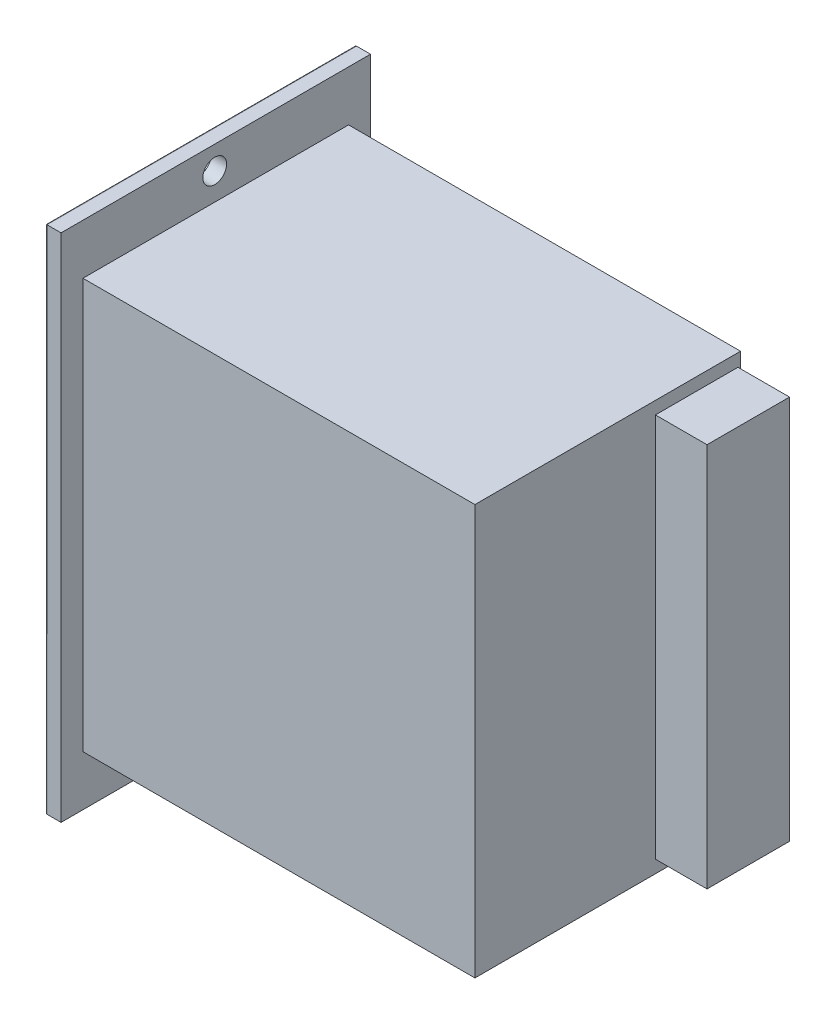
ISO-10303-21;
HEADER;
FILE_DESCRIPTION(('STEP AP214'),'2;1');
FILE_NAME('part.step','',(''),(''),'','','');
FILE_SCHEMA(('AUTOMOTIVE_DESIGN { 1 0 10303 214 1 1 1 1 }'));
ENDSEC;
DATA;
#1=APPLICATION_CONTEXT('core data for automotive mechanical design processes');
#2=APPLICATION_PROTOCOL_DEFINITION('international standard','automotive_design',2000,#1);
#3=PRODUCT_CONTEXT('',#1,'mechanical');
#4=PRODUCT('Part','Part','',(#3));
#5=PRODUCT_RELATED_PRODUCT_CATEGORY('part','',(#4));
#6=PRODUCT_DEFINITION_FORMATION('','',#4);
#7=PRODUCT_DEFINITION_CONTEXT('part definition',#1,'design');
#8=PRODUCT_DEFINITION('design','',#6,#7);
#9=PRODUCT_DEFINITION_SHAPE('','',#8);
#10=(LENGTH_UNIT() NAMED_UNIT(*) SI_UNIT(.MILLI.,.METRE.));
#11=(NAMED_UNIT(*) PLANE_ANGLE_UNIT() SI_UNIT($,.RADIAN.));
#12=(NAMED_UNIT(*) SI_UNIT($,.STERADIAN.) SOLID_ANGLE_UNIT());
#13=UNCERTAINTY_MEASURE_WITH_UNIT(LENGTH_MEASURE(1.E-05),#10,'distance_accuracy_value','');
#14=(GEOMETRIC_REPRESENTATION_CONTEXT(3) GLOBAL_UNCERTAINTY_ASSIGNED_CONTEXT((#13)) GLOBAL_UNIT_ASSIGNED_CONTEXT((#10,
#11,#12)) REPRESENTATION_CONTEXT('',''));
#15=CARTESIAN_POINT('',(0.,0.,0.));
#16=DIRECTION('',(0.,0.,1.));
#17=DIRECTION('',(1.,0.,0.));
#18=AXIS2_PLACEMENT_3D('',#15,#16,#17);
#19=CARTESIAN_POINT('',(-1.6,0.,0.));
#20=DIRECTION('',(1.,0.,0.));
#21=DIRECTION('',(0.,0.,-1.));
#22=AXIS2_PLACEMENT_3D('',#19,#20,#21);
#23=PLANE('',#22);
#24=DIRECTION('',(0.,-1.,0.));
#25=VECTOR('',#24,1.);
#26=CARTESIAN_POINT('',(-1.6,0.,-23.9));
#27=LINE('',#26,#25);
#28=CARTESIAN_POINT('',(-1.6,37.15,-23.9));
#29=VERTEX_POINT('',#28);
#30=CARTESIAN_POINT('',(-1.6,-37.15,-23.9));
#31=VERTEX_POINT('',#30);
#32=EDGE_CURVE('E55',#29,#31,#27,.T.);
#33=ORIENTED_EDGE('',*,*,#32,.T.);
#34=DIRECTION('',(0.,0.,1.));
#35=VECTOR('',#34,1.);
#36=CARTESIAN_POINT('',(-1.6,-37.15,0.));
#37=LINE('',#36,#35);
#38=CARTESIAN_POINT('',(-1.6,-37.15,23.9));
#39=VERTEX_POINT('',#38);
#40=EDGE_CURVE('E12',#31,#39,#37,.T.);
#41=ORIENTED_EDGE('',*,*,#40,.T.);
#42=DIRECTION('',(0.,1.,0.));
#43=VECTOR('',#42,1.);
#44=CARTESIAN_POINT('',(-1.6,0.,23.9));
#45=LINE('',#44,#43);
#46=CARTESIAN_POINT('',(-1.6,37.15,23.9));
#47=VERTEX_POINT('',#46);
#48=EDGE_CURVE('E111',#39,#47,#45,.T.);
#49=ORIENTED_EDGE('',*,*,#48,.T.);
#50=DIRECTION('',(0.,0.,-1.));
#51=VECTOR('',#50,1.);
#52=CARTESIAN_POINT('',(-1.6,37.15,0.));
#53=LINE('',#52,#51);
#54=EDGE_CURVE('E66',#47,#29,#53,.T.);
#55=ORIENTED_EDGE('',*,*,#54,.T.);
#56=EDGE_LOOP('',(#33,#41,#49,#55));
#57=FACE_BOUND('',#56,.T.);
#58=ADVANCED_FACE('F46',(#57),#23,.F.);
#59=CARTESIAN_POINT('',(0.,0.,0.));
#60=DIRECTION('',(1.,0.,0.));
#61=DIRECTION('',(0.,0.,-1.));
#62=AXIS2_PLACEMENT_3D('',#59,#60,#61);
#63=PLANE('',#62);
#64=DIRECTION('',(0.,1.,0.));
#65=VECTOR('',#64,1.);
#66=CARTESIAN_POINT('',(0.,-38.75,25.5));
#67=LINE('',#66,#65);
#68=CARTESIAN_POINT('',(0.,-38.75,25.5));
#69=VERTEX_POINT('',#68);
#70=CARTESIAN_POINT('',(0.,38.75,25.5));
#71=VERTEX_POINT('',#70);
#72=EDGE_CURVE('E91',#69,#71,#67,.T.);
#73=ORIENTED_EDGE('',*,*,#72,.F.);
#74=DIRECTION('',(0.,0.,1.));
#75=VECTOR('',#74,1.);
#76=CARTESIAN_POINT('',(0.,-38.75,-25.5));
#77=LINE('',#76,#75);
#78=CARTESIAN_POINT('',(0.,-38.75,-25.5));
#79=VERTEX_POINT('',#78);
#80=EDGE_CURVE('E109',#79,#69,#77,.T.);
#81=ORIENTED_EDGE('',*,*,#80,.F.);
#82=DIRECTION('',(0.,-1.,0.));
#83=VECTOR('',#82,1.);
#84=CARTESIAN_POINT('',(0.,-38.75,-25.5));
#85=LINE('',#84,#83);
#86=CARTESIAN_POINT('',(0.,38.75,-25.5));
#87=VERTEX_POINT('',#86);
#88=EDGE_CURVE('E94',#87,#79,#85,.T.);
#89=ORIENTED_EDGE('',*,*,#88,.F.);
#90=DIRECTION('',(0.,0.,-1.));
#91=VECTOR('',#90,1.);
#92=CARTESIAN_POINT('',(0.,38.75,-25.5));
#93=LINE('',#92,#91);
#94=EDGE_CURVE('E86',#71,#87,#93,.T.);
#95=ORIENTED_EDGE('',*,*,#94,.F.);
#96=EDGE_LOOP('',(#73,#81,#89,#95));
#97=FACE_BOUND('',#96,.T.);
#98=ADVANCED_FACE('F88',(#97),#63,.T.);
#99=CARTESIAN_POINT('',(-1.6,37.15,0.));
#100=DIRECTION('',(0.707106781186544,-0.707106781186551,0.));
#101=DIRECTION('',(0.,0.,-1.));
#102=AXIS2_PLACEMENT_3D('',#99,#100,#101);
#103=PLANE('',#102);
#104=DIRECTION('',(-0.577350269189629,-0.577350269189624,-0.577350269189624));
#105=VECTOR('',#104,1.);
#106=CARTESIAN_POINT('',(-13.9833333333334,24.7666666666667,11.5166666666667));
#107=LINE('',#106,#105);
#108=EDGE_CURVE('E99',#71,#47,#107,.T.);
#109=ORIENTED_EDGE('',*,*,#108,.F.);
#110=ORIENTED_EDGE('',*,*,#94,.T.);
#111=DIRECTION('',(-0.577350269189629,-0.577350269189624,0.577350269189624));
#112=VECTOR('',#111,1.);
#113=CARTESIAN_POINT('',(-9.5666666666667,29.1833333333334,-15.9333333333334));
#114=LINE('',#113,#112);
#115=EDGE_CURVE('E50',#29,#87,#114,.F.);
#116=ORIENTED_EDGE('',*,*,#115,.F.);
#117=ORIENTED_EDGE('',*,*,#54,.F.);
#118=EDGE_LOOP('',(#109,#110,#116,#117));
#119=FACE_BOUND('',#118,.T.);
#120=ADVANCED_FACE('F48',(#119),#103,.F.);
#121=CARTESIAN_POINT('',(-1.6,0.,-23.9));
#122=DIRECTION('',(0.707106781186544,0.,0.707106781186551));
#123=DIRECTION('',(0.,-1.,0.));
#124=AXIS2_PLACEMENT_3D('',#121,#122,#123);
#125=PLANE('',#124);
#126=ORIENTED_EDGE('',*,*,#115,.T.);
#127=ORIENTED_EDGE('',*,*,#88,.T.);
#128=DIRECTION('',(-0.577350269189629,0.577350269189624,0.577350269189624));
#129=VECTOR('',#128,1.);
#130=CARTESIAN_POINT('',(-13.9833333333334,-24.7666666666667,-11.5166666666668));
#131=LINE('',#130,#129);
#132=EDGE_CURVE('E102',#31,#79,#131,.F.);
#133=ORIENTED_EDGE('',*,*,#132,.F.);
#134=ORIENTED_EDGE('',*,*,#32,.F.);
#135=EDGE_LOOP('',(#126,#127,#133,#134));
#136=FACE_BOUND('',#135,.T.);
#137=ADVANCED_FACE('F120',(#136),#125,.F.);
#138=CARTESIAN_POINT('',(-1.6,0.,23.9));
#139=DIRECTION('',(0.707106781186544,0.,-0.707106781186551));
#140=DIRECTION('',(0.,1.,0.));
#141=AXIS2_PLACEMENT_3D('',#138,#139,#140);
#142=PLANE('',#141);
#143=ORIENTED_EDGE('',*,*,#108,.T.);
#144=ORIENTED_EDGE('',*,*,#48,.F.);
#145=DIRECTION('',(0.577350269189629,-0.577350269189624,0.577350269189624));
#146=VECTOR('',#145,1.);
#147=CARTESIAN_POINT('',(-13.9833333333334,-24.7666666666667,11.5166666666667));
#148=LINE('',#147,#146);
#149=EDGE_CURVE('E105',#69,#39,#148,.F.);
#150=ORIENTED_EDGE('',*,*,#149,.F.);
#151=ORIENTED_EDGE('',*,*,#72,.T.);
#152=EDGE_LOOP('',(#143,#144,#150,#151));
#153=FACE_BOUND('',#152,.T.);
#154=ADVANCED_FACE('F104',(#153),#142,.F.);
#155=CARTESIAN_POINT('',(-1.6,-37.15,0.));
#156=DIRECTION('',(0.707106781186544,0.707106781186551,0.));
#157=DIRECTION('',(0.,0.,1.));
#158=AXIS2_PLACEMENT_3D('',#155,#156,#157);
#159=PLANE('',#158);
#160=ORIENTED_EDGE('',*,*,#132,.T.);
#161=ORIENTED_EDGE('',*,*,#80,.T.);
#162=ORIENTED_EDGE('',*,*,#149,.T.);
#163=ORIENTED_EDGE('',*,*,#40,.F.);
#164=EDGE_LOOP('',(#160,#161,#162,#163));
#165=FACE_BOUND('',#164,.T.);
#166=ADVANCED_FACE('F118',(#165),#159,.F.);
#167=CLOSED_SHELL('',(#58,#98,#120,#137,#154,#166));
#168=MANIFOLD_SOLID_BREP('B2',#167);
#169=CARTESIAN_POINT('',(89.,37.3,-9.25000000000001));
#170=DIRECTION('',(0.,-1.,0.));
#171=DIRECTION('',(0.,0.,-1.));
#172=AXIS2_PLACEMENT_3D('',#169,#170,#171);
#173=PLANE('',#172);
#174=DIRECTION('',(0.,0.,1.));
#175=VECTOR('',#174,1.);
#176=CARTESIAN_POINT('',(79.,37.3,-9.25000000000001));
#177=LINE('',#176,#175);
#178=CARTESIAN_POINT('',(79.,37.3,-25.25));
#179=VERTEX_POINT('',#178);
#180=CARTESIAN_POINT('',(79.,37.3,-9.25000000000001));
#181=VERTEX_POINT('',#180);
#182=EDGE_CURVE('E243',#179,#181,#177,.T.);
#183=ORIENTED_EDGE('',*,*,#182,.T.);
#184=DIRECTION('',(-1.,0.,0.));
#185=VECTOR('',#184,1.);
#186=CARTESIAN_POINT('',(89.,37.3,-9.25000000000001));
#187=LINE('',#186,#185);
#188=CARTESIAN_POINT('',(89.,37.3,-9.25000000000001));
#189=VERTEX_POINT('',#188);
#190=EDGE_CURVE('E44',#189,#181,#187,.T.);
#191=ORIENTED_EDGE('',*,*,#190,.F.);
#192=DIRECTION('',(0.,0.,1.));
#193=VECTOR('',#192,1.);
#194=CARTESIAN_POINT('',(89.,37.3,-9.25000000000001));
#195=LINE('',#194,#193);
#196=CARTESIAN_POINT('',(89.,37.3,-25.25));
#197=VERTEX_POINT('',#196);
#198=EDGE_CURVE('E231',#197,#189,#195,.T.);
#199=ORIENTED_EDGE('',*,*,#198,.F.);
#200=DIRECTION('',(-1.,0.,0.));
#201=VECTOR('',#200,1.);
#202=CARTESIAN_POINT('',(89.,37.3,-25.25));
#203=LINE('',#202,#201);
#204=EDGE_CURVE('E239',#197,#179,#203,.T.);
#205=ORIENTED_EDGE('',*,*,#204,.T.);
#206=EDGE_LOOP('',(#183,#191,#199,#205));
#207=FACE_BOUND('',#206,.T.);
#208=ADVANCED_FACE('F180',(#207),#173,.F.);
#209=CARTESIAN_POINT('',(89.,-37.3,-9.25000000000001));
#210=DIRECTION('',(0.,0.,-1.));
#211=DIRECTION('',(-1.,0.,0.));
#212=AXIS2_PLACEMENT_3D('',#209,#210,#211);
#213=PLANE('',#212);
#214=DIRECTION('',(0.,-1.,0.));
#215=VECTOR('',#214,1.);
#216=CARTESIAN_POINT('',(79.,-37.3,-9.25000000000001));
#217=LINE('',#216,#215);
#218=CARTESIAN_POINT('',(79.,-37.3,-9.25000000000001));
#219=VERTEX_POINT('',#218);
#220=EDGE_CURVE('E235',#181,#219,#217,.T.);
#221=ORIENTED_EDGE('',*,*,#220,.T.);
#222=DIRECTION('',(-1.,0.,0.));
#223=VECTOR('',#222,1.);
#224=CARTESIAN_POINT('',(89.,-37.3,-9.25000000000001));
#225=LINE('',#224,#223);
#226=CARTESIAN_POINT('',(89.,-37.3,-9.25000000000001));
#227=VERTEX_POINT('',#226);
#228=EDGE_CURVE('E188',#227,#219,#225,.T.);
#229=ORIENTED_EDGE('',*,*,#228,.F.);
#230=DIRECTION('',(0.,-1.,0.));
#231=VECTOR('',#230,1.);
#232=CARTESIAN_POINT('',(89.,-37.3,-9.25000000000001));
#233=LINE('',#232,#231);
#234=EDGE_CURVE('E226',#189,#227,#233,.T.);
#235=ORIENTED_EDGE('',*,*,#234,.F.);
#236=ORIENTED_EDGE('',*,*,#190,.T.);
#237=EDGE_LOOP('',(#221,#229,#235,#236));
#238=FACE_BOUND('',#237,.T.);
#239=ADVANCED_FACE('F234',(#238),#213,.F.);
#240=CARTESIAN_POINT('',(89.,-37.3,-25.25));
#241=DIRECTION('',(0.,1.,0.));
#242=DIRECTION('',(0.,0.,1.));
#243=AXIS2_PLACEMENT_3D('',#240,#241,#242);
#244=PLANE('',#243);
#245=DIRECTION('',(0.,0.,-1.));
#246=VECTOR('',#245,1.);
#247=CARTESIAN_POINT('',(79.,-37.3,-25.25));
#248=LINE('',#247,#246);
#249=CARTESIAN_POINT('',(79.,-37.3,-25.25));
#250=VERTEX_POINT('',#249);
#251=EDGE_CURVE('E213',#219,#250,#248,.T.);
#252=ORIENTED_EDGE('',*,*,#251,.T.);
#253=DIRECTION('',(-1.,0.,0.));
#254=VECTOR('',#253,1.);
#255=CARTESIAN_POINT('',(89.,-37.3,-25.25));
#256=LINE('',#255,#254);
#257=CARTESIAN_POINT('',(89.,-37.3,-25.25));
#258=VERTEX_POINT('',#257);
#259=EDGE_CURVE('E236',#258,#250,#256,.T.);
#260=ORIENTED_EDGE('',*,*,#259,.F.);
#261=DIRECTION('',(0.,0.,-1.));
#262=VECTOR('',#261,1.);
#263=CARTESIAN_POINT('',(89.,-37.3,-25.25));
#264=LINE('',#263,#262);
#265=EDGE_CURVE('E229',#227,#258,#264,.T.);
#266=ORIENTED_EDGE('',*,*,#265,.F.);
#267=ORIENTED_EDGE('',*,*,#228,.T.);
#268=EDGE_LOOP('',(#252,#260,#266,#267));
#269=FACE_BOUND('',#268,.T.);
#270=ADVANCED_FACE('F237',(#269),#244,.F.);
#271=CARTESIAN_POINT('',(89.,37.3,-25.25));
#272=DIRECTION('',(0.,0.,1.));
#273=DIRECTION('',(0.,-1.,0.));
#274=AXIS2_PLACEMENT_3D('',#271,#272,#273);
#275=PLANE('',#274);
#276=DIRECTION('',(0.,1.,0.));
#277=VECTOR('',#276,1.);
#278=CARTESIAN_POINT('',(79.,37.3,-25.25));
#279=LINE('',#278,#277);
#280=EDGE_CURVE('E219',#250,#179,#279,.T.);
#281=ORIENTED_EDGE('',*,*,#280,.T.);
#282=ORIENTED_EDGE('',*,*,#204,.F.);
#283=DIRECTION('',(0.,1.,0.));
#284=VECTOR('',#283,1.);
#285=CARTESIAN_POINT('',(89.,37.3,-25.25));
#286=LINE('',#285,#284);
#287=EDGE_CURVE('E196',#258,#197,#286,.T.);
#288=ORIENTED_EDGE('',*,*,#287,.F.);
#289=ORIENTED_EDGE('',*,*,#259,.T.);
#290=EDGE_LOOP('',(#281,#282,#288,#289));
#291=FACE_BOUND('',#290,.T.);
#292=ADVANCED_FACE('F250',(#291),#275,.F.);
#293=CARTESIAN_POINT('',(89.,0.,0.));
#294=DIRECTION('',(-1.,0.,0.));
#295=DIRECTION('',(0.,0.,1.));
#296=AXIS2_PLACEMENT_3D('',#293,#294,#295);
#297=PLANE('',#296);
#298=ORIENTED_EDGE('',*,*,#198,.T.);
#299=ORIENTED_EDGE('',*,*,#234,.T.);
#300=ORIENTED_EDGE('',*,*,#265,.T.);
#301=ORIENTED_EDGE('',*,*,#287,.T.);
#302=EDGE_LOOP('',(#298,#299,#300,#301));
#303=FACE_BOUND('',#302,.T.);
#304=ADVANCED_FACE('F227',(#303),#297,.F.);
#305=CARTESIAN_POINT('',(79.,0.,0.));
#306=DIRECTION('',(-1.,0.,0.));
#307=DIRECTION('',(0.,0.,1.));
#308=AXIS2_PLACEMENT_3D('',#305,#306,#307);
#309=PLANE('',#308);
#310=ORIENTED_EDGE('',*,*,#182,.F.);
#311=ORIENTED_EDGE('',*,*,#280,.F.);
#312=ORIENTED_EDGE('',*,*,#251,.F.);
#313=ORIENTED_EDGE('',*,*,#220,.F.);
#314=EDGE_LOOP('',(#310,#311,#312,#313));
#315=FACE_BOUND('',#314,.T.);
#316=ADVANCED_FACE('F253',(#315),#309,.T.);
#317=CLOSED_SHELL('',(#208,#239,#270,#292,#304,#316));
#318=MANIFOLD_SOLID_BREP('B6',#317);
#319=CARTESIAN_POINT('',(79.,-39.75,-25.75));
#320=DIRECTION('',(0.,0.,1.));
#321=DIRECTION('',(1.,0.,0.));
#322=AXIS2_PLACEMENT_3D('',#319,#320,#321);
#323=PLANE('',#322);
#324=DIRECTION('',(0.,1.,0.));
#325=VECTOR('',#324,1.);
#326=CARTESIAN_POINT('',(3.,-39.75,-25.75));
#327=LINE('',#326,#325);
#328=CARTESIAN_POINT('',(3.,-39.75,-25.75));
#329=VERTEX_POINT('',#328);
#330=CARTESIAN_POINT('',(3.,39.75,-25.75));
#331=VERTEX_POINT('',#330);
#332=EDGE_CURVE('E376',#329,#331,#327,.T.);
#333=ORIENTED_EDGE('',*,*,#332,.T.);
#334=DIRECTION('',(-1.,0.,0.));
#335=VECTOR('',#334,1.);
#336=CARTESIAN_POINT('',(79.,39.75,-25.75));
#337=LINE('',#336,#335);
#338=CARTESIAN_POINT('',(79.,39.75,-25.75));
#339=VERTEX_POINT('',#338);
#340=EDGE_CURVE('E178',#339,#331,#337,.T.);
#341=ORIENTED_EDGE('',*,*,#340,.F.);
#342=DIRECTION('',(0.,1.,0.));
#343=VECTOR('',#342,1.);
#344=CARTESIAN_POINT('',(79.,-39.75,-25.75));
#345=LINE('',#344,#343);
#346=CARTESIAN_POINT('',(79.,-39.75,-25.75));
#347=VERTEX_POINT('',#346);
#348=EDGE_CURVE('E364',#347,#339,#345,.T.);
#349=ORIENTED_EDGE('',*,*,#348,.F.);
#350=DIRECTION('',(-1.,0.,0.));
#351=VECTOR('',#350,1.);
#352=CARTESIAN_POINT('',(79.,-39.75,-25.75));
#353=LINE('',#352,#351);
#354=EDGE_CURVE('E372',#347,#329,#353,.T.);
#355=ORIENTED_EDGE('',*,*,#354,.T.);
#356=EDGE_LOOP('',(#333,#341,#349,#355));
#357=FACE_BOUND('',#356,.T.);
#358=ADVANCED_FACE('F313',(#357),#323,.F.);
#359=CARTESIAN_POINT('',(79.,39.75,25.75));
#360=DIRECTION('',(0.,-1.,0.));
#361=DIRECTION('',(0.,0.,-1.));
#362=AXIS2_PLACEMENT_3D('',#359,#360,#361);
#363=PLANE('',#362);
#364=DIRECTION('',(0.,0.,1.));
#365=VECTOR('',#364,1.);
#366=CARTESIAN_POINT('',(3.,39.75,25.75));
#367=LINE('',#366,#365);
#368=CARTESIAN_POINT('',(3.,39.75,25.75));
#369=VERTEX_POINT('',#368);
#370=EDGE_CURVE('E368',#331,#369,#367,.T.);
#371=ORIENTED_EDGE('',*,*,#370,.T.);
#372=DIRECTION('',(-1.,0.,0.));
#373=VECTOR('',#372,1.);
#374=CARTESIAN_POINT('',(79.,39.75,25.75));
#375=LINE('',#374,#373);
#376=CARTESIAN_POINT('',(79.,39.75,25.75));
#377=VERTEX_POINT('',#376);
#378=EDGE_CURVE('E321',#377,#369,#375,.T.);
#379=ORIENTED_EDGE('',*,*,#378,.F.);
#380=DIRECTION('',(0.,0.,1.));
#381=VECTOR('',#380,1.);
#382=CARTESIAN_POINT('',(79.,39.75,25.75));
#383=LINE('',#382,#381);
#384=EDGE_CURVE('E359',#339,#377,#383,.T.);
#385=ORIENTED_EDGE('',*,*,#384,.F.);
#386=ORIENTED_EDGE('',*,*,#340,.T.);
#387=EDGE_LOOP('',(#371,#379,#385,#386));
#388=FACE_BOUND('',#387,.T.);
#389=ADVANCED_FACE('F367',(#388),#363,.F.);
#390=CARTESIAN_POINT('',(79.,-39.75,25.75));
#391=DIRECTION('',(0.,0.,-1.));
#392=DIRECTION('',(-1.,0.,0.));
#393=AXIS2_PLACEMENT_3D('',#390,#391,#392);
#394=PLANE('',#393);
#395=DIRECTION('',(0.,-1.,0.));
#396=VECTOR('',#395,1.);
#397=CARTESIAN_POINT('',(3.,-39.75,25.75));
#398=LINE('',#397,#396);
#399=CARTESIAN_POINT('',(3.,-39.75,25.75));
#400=VERTEX_POINT('',#399);
#401=EDGE_CURVE('E346',#369,#400,#398,.T.);
#402=ORIENTED_EDGE('',*,*,#401,.T.);
#403=DIRECTION('',(-1.,0.,0.));
#404=VECTOR('',#403,1.);
#405=CARTESIAN_POINT('',(79.,-39.75,25.75));
#406=LINE('',#405,#404);
#407=CARTESIAN_POINT('',(79.,-39.75,25.75));
#408=VERTEX_POINT('',#407);
#409=EDGE_CURVE('E369',#408,#400,#406,.T.);
#410=ORIENTED_EDGE('',*,*,#409,.F.);
#411=DIRECTION('',(0.,-1.,0.));
#412=VECTOR('',#411,1.);
#413=CARTESIAN_POINT('',(79.,-39.75,25.75));
#414=LINE('',#413,#412);
#415=EDGE_CURVE('E362',#377,#408,#414,.T.);
#416=ORIENTED_EDGE('',*,*,#415,.F.);
#417=ORIENTED_EDGE('',*,*,#378,.T.);
#418=EDGE_LOOP('',(#402,#410,#416,#417));
#419=FACE_BOUND('',#418,.T.);
#420=ADVANCED_FACE('F370',(#419),#394,.F.);
#421=CARTESIAN_POINT('',(79.,-39.75,25.75));
#422=DIRECTION('',(0.,1.,0.));
#423=DIRECTION('',(0.,0.,1.));
#424=AXIS2_PLACEMENT_3D('',#421,#422,#423);
#425=PLANE('',#424);
#426=DIRECTION('',(0.,0.,-1.));
#427=VECTOR('',#426,1.);
#428=CARTESIAN_POINT('',(3.,-39.75,25.75));
#429=LINE('',#428,#427);
#430=EDGE_CURVE('E352',#400,#329,#429,.T.);
#431=ORIENTED_EDGE('',*,*,#430,.T.);
#432=ORIENTED_EDGE('',*,*,#354,.F.);
#433=DIRECTION('',(0.,0.,-1.));
#434=VECTOR('',#433,1.);
#435=CARTESIAN_POINT('',(79.,-39.75,25.75));
#436=LINE('',#435,#434);
#437=EDGE_CURVE('E329',#408,#347,#436,.T.);
#438=ORIENTED_EDGE('',*,*,#437,.F.);
#439=ORIENTED_EDGE('',*,*,#409,.T.);
#440=EDGE_LOOP('',(#431,#432,#438,#439));
#441=FACE_BOUND('',#440,.T.);
#442=ADVANCED_FACE('F383',(#441),#425,.F.);
#443=CARTESIAN_POINT('',(79.,0.,0.));
#444=DIRECTION('',(-1.,0.,0.));
#445=DIRECTION('',(0.,0.,1.));
#446=AXIS2_PLACEMENT_3D('',#443,#444,#445);
#447=PLANE('',#446);
#448=ORIENTED_EDGE('',*,*,#348,.T.);
#449=ORIENTED_EDGE('',*,*,#384,.T.);
#450=ORIENTED_EDGE('',*,*,#415,.T.);
#451=ORIENTED_EDGE('',*,*,#437,.T.);
#452=EDGE_LOOP('',(#448,#449,#450,#451));
#453=FACE_BOUND('',#452,.T.);
#454=ADVANCED_FACE('F360',(#453),#447,.F.);
#455=CARTESIAN_POINT('',(3.,0.,0.));
#456=DIRECTION('',(-1.,0.,0.));
#457=DIRECTION('',(0.,0.,1.));
#458=AXIS2_PLACEMENT_3D('',#455,#456,#457);
#459=PLANE('',#458);
#460=ORIENTED_EDGE('',*,*,#332,.F.);
#461=ORIENTED_EDGE('',*,*,#430,.F.);
#462=ORIENTED_EDGE('',*,*,#401,.F.);
#463=ORIENTED_EDGE('',*,*,#370,.F.);
#464=EDGE_LOOP('',(#460,#461,#462,#463));
#465=FACE_BOUND('',#464,.T.);
#466=ADVANCED_FACE('F386',(#465),#459,.T.);
#467=CLOSED_SHELL('',(#358,#389,#420,#442,#454,#466));
#468=MANIFOLD_SOLID_BREP('B38',#467);
#469=CARTESIAN_POINT('',(3.,-49.5,-30.));
#470=DIRECTION('',(0.,0.,1.));
#471=DIRECTION('',(1.,0.,0.));
#472=AXIS2_PLACEMENT_3D('',#469,#470,#471);
#473=PLANE('',#472);
#474=DIRECTION('',(-1.,0.,0.));
#475=VECTOR('',#474,1.);
#476=CARTESIAN_POINT('',(3.,-49.5,-30.));
#477=LINE('',#476,#475);
#478=CARTESIAN_POINT('',(3.,-49.5,-30.));
#479=VERTEX_POINT('',#478);
#480=CARTESIAN_POINT('',(0.3,-49.5,-30.));
#481=VERTEX_POINT('',#480);
#482=EDGE_CURVE('E555',#479,#481,#477,.T.);
#483=ORIENTED_EDGE('',*,*,#482,.T.);
#484=DIRECTION('',(0.,1.,0.));
#485=VECTOR('',#484,1.);
#486=CARTESIAN_POINT('',(0.3,49.5,-30.));
#487=LINE('',#486,#485);
#488=CARTESIAN_POINT('',(0.3,49.5,-30.));
#489=VERTEX_POINT('',#488);
#490=EDGE_CURVE('E446',#481,#489,#487,.T.);
#491=ORIENTED_EDGE('',*,*,#490,.T.);
#492=DIRECTION('',(-1.,0.,0.));
#493=VECTOR('',#492,1.);
#494=CARTESIAN_POINT('',(3.,49.5,-30.));
#495=LINE('',#494,#493);
#496=CARTESIAN_POINT('',(3.,49.5,-30.));
#497=VERTEX_POINT('',#496);
#498=EDGE_CURVE('E492',#497,#489,#495,.T.);
#499=ORIENTED_EDGE('',*,*,#498,.F.);
#500=DIRECTION('',(0.,1.,0.));
#501=VECTOR('',#500,1.);
#502=CARTESIAN_POINT('',(3.,-49.5,-30.));
#503=LINE('',#502,#501);
#504=EDGE_CURVE('E497',#479,#497,#503,.T.);
#505=ORIENTED_EDGE('',*,*,#504,.F.);
#506=EDGE_LOOP('',(#483,#491,#499,#505));
#507=FACE_BOUND('',#506,.T.);
#508=ADVANCED_FACE('F437',(#507),#473,.F.);
#509=CARTESIAN_POINT('',(3.,49.5,30.));
#510=DIRECTION('',(0.,-1.,0.));
#511=DIRECTION('',(0.,0.,-1.));
#512=AXIS2_PLACEMENT_3D('',#509,#510,#511);
#513=PLANE('',#512);
#514=ORIENTED_EDGE('',*,*,#498,.T.);
#515=DIRECTION('',(0.,0.,1.));
#516=VECTOR('',#515,1.);
#517=CARTESIAN_POINT('',(0.3,49.5,30.));
#518=LINE('',#517,#516);
#519=CARTESIAN_POINT('',(0.3,49.5,30.));
#520=VERTEX_POINT('',#519);
#521=EDGE_CURVE('E311',#489,#520,#518,.T.);
#522=ORIENTED_EDGE('',*,*,#521,.T.);
#523=DIRECTION('',(-1.,0.,0.));
#524=VECTOR('',#523,1.);
#525=CARTESIAN_POINT('',(3.,49.5,30.));
#526=LINE('',#525,#524);
#527=CARTESIAN_POINT('',(3.,49.5,30.));
#528=VERTEX_POINT('',#527);
#529=EDGE_CURVE('E493',#528,#520,#526,.T.);
#530=ORIENTED_EDGE('',*,*,#529,.F.);
#531=DIRECTION('',(0.,0.,1.));
#532=VECTOR('',#531,1.);
#533=CARTESIAN_POINT('',(3.,49.5,30.));
#534=LINE('',#533,#532);
#535=EDGE_CURVE('E489',#497,#528,#534,.T.);
#536=ORIENTED_EDGE('',*,*,#535,.F.);
#537=EDGE_LOOP('',(#514,#522,#530,#536));
#538=FACE_BOUND('',#537,.T.);
#539=ADVANCED_FACE('F491',(#538),#513,.F.);
#540=CARTESIAN_POINT('',(3.,-49.5,30.));
#541=DIRECTION('',(0.,0.,-1.));
#542=DIRECTION('',(-1.,0.,0.));
#543=AXIS2_PLACEMENT_3D('',#540,#541,#542);
#544=PLANE('',#543);
#545=ORIENTED_EDGE('',*,*,#529,.T.);
#546=DIRECTION('',(0.,-1.,0.));
#547=VECTOR('',#546,1.);
#548=CARTESIAN_POINT('',(0.3,-49.5,30.));
#549=LINE('',#548,#547);
#550=CARTESIAN_POINT('',(0.3,-49.5,30.));
#551=VERTEX_POINT('',#550);
#552=EDGE_CURVE('E523',#520,#551,#549,.T.);
#553=ORIENTED_EDGE('',*,*,#552,.T.);
#554=DIRECTION('',(-1.,0.,0.));
#555=VECTOR('',#554,1.);
#556=CARTESIAN_POINT('',(3.,-49.5,30.));
#557=LINE('',#556,#555);
#558=CARTESIAN_POINT('',(3.,-49.5,30.));
#559=VERTEX_POINT('',#558);
#560=EDGE_CURVE('E511',#559,#551,#557,.T.);
#561=ORIENTED_EDGE('',*,*,#560,.F.);
#562=DIRECTION('',(0.,-1.,0.));
#563=VECTOR('',#562,1.);
#564=CARTESIAN_POINT('',(3.,-49.5,30.));
#565=LINE('',#564,#563);
#566=EDGE_CURVE('E496',#528,#559,#565,.T.);
#567=ORIENTED_EDGE('',*,*,#566,.F.);
#568=EDGE_LOOP('',(#545,#553,#561,#567));
#569=FACE_BOUND('',#568,.T.);
#570=ADVANCED_FACE('F581',(#569),#544,.F.);
#571=CARTESIAN_POINT('',(3.,-49.5,30.));
#572=DIRECTION('',(0.,1.,0.));
#573=DIRECTION('',(0.,0.,1.));
#574=AXIS2_PLACEMENT_3D('',#571,#572,#573);
#575=PLANE('',#574);
#576=ORIENTED_EDGE('',*,*,#560,.T.);
#577=DIRECTION('',(0.,0.,-1.));
#578=VECTOR('',#577,1.);
#579=CARTESIAN_POINT('',(0.3,-49.5,-30.));
#580=LINE('',#579,#578);
#581=EDGE_CURVE('E506',#551,#481,#580,.T.);
#582=ORIENTED_EDGE('',*,*,#581,.T.);
#583=ORIENTED_EDGE('',*,*,#482,.F.);
#584=DIRECTION('',(0.,0.,-1.));
#585=VECTOR('',#584,1.);
#586=CARTESIAN_POINT('',(3.,-49.5,30.));
#587=LINE('',#586,#585);
#588=EDGE_CURVE('E502',#559,#479,#587,.T.);
#589=ORIENTED_EDGE('',*,*,#588,.F.);
#590=EDGE_LOOP('',(#576,#582,#583,#589));
#591=FACE_BOUND('',#590,.T.);
#592=ADVANCED_FACE('F560',(#591),#575,.F.);
#593=CARTESIAN_POINT('',(3.,0.,0.));
#594=DIRECTION('',(-1.,0.,0.));
#595=DIRECTION('',(0.,0.,1.));
#596=AXIS2_PLACEMENT_3D('',#593,#594,#595);
#597=PLANE('',#596);
#598=CARTESIAN_POINT('',(3.,-45.,0.200000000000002));
#599=DIRECTION('',(-1.,0.,0.));
#600=DIRECTION('',(0.,0.,1.));
#601=AXIS2_PLACEMENT_3D('',#598,#599,#600);
#602=CIRCLE('',#601,2.3);
#603=CARTESIAN_POINT('',(3.,-45.,2.5));
#604=VERTEX_POINT('',#603);
#605=EDGE_CURVE('E541',#604,#604,#602,.T.);
#606=ORIENTED_EDGE('',*,*,#605,.T.);
#607=EDGE_LOOP('',(#606));
#608=FACE_BOUND('',#607,.T.);
#609=CARTESIAN_POINT('',(3.,45.,0.200000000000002));
#610=DIRECTION('',(-1.,0.,0.));
#611=DIRECTION('',(0.,0.,1.));
#612=AXIS2_PLACEMENT_3D('',#609,#610,#611);
#613=CIRCLE('',#612,2.3);
#614=CARTESIAN_POINT('',(3.,45.,2.5));
#615=VERTEX_POINT('',#614);
#616=EDGE_CURVE('E504',#615,#615,#613,.T.);
#617=ORIENTED_EDGE('',*,*,#616,.T.);
#618=EDGE_LOOP('',(#617));
#619=FACE_BOUND('',#618,.T.);
#620=ORIENTED_EDGE('',*,*,#504,.T.);
#621=ORIENTED_EDGE('',*,*,#535,.T.);
#622=ORIENTED_EDGE('',*,*,#566,.T.);
#623=ORIENTED_EDGE('',*,*,#588,.T.);
#624=EDGE_LOOP('',(#620,#621,#622,#623));
#625=FACE_BOUND('',#624,.T.);
#626=ADVANCED_FACE('F500',(#608,#619,#625),#597,.F.);
#627=CARTESIAN_POINT('',(0.,0.,0.));
#628=DIRECTION('',(-1.,0.,0.));
#629=DIRECTION('',(0.,0.,1.));
#630=AXIS2_PLACEMENT_3D('',#627,#628,#629);
#631=PLANE('',#630);
#632=DIRECTION('',(0.,1.,0.));
#633=VECTOR('',#632,1.);
#634=CARTESIAN_POINT('',(0.,-49.5,-29.7));
#635=LINE('',#634,#633);
#636=CARTESIAN_POINT('',(0.,49.2,-29.7));
#637=VERTEX_POINT('',#636);
#638=CARTESIAN_POINT('',(0.,-49.2,-29.7));
#639=VERTEX_POINT('',#638);
#640=EDGE_CURVE('E516',#637,#639,#635,.F.);
#641=ORIENTED_EDGE('',*,*,#640,.T.);
#642=DIRECTION('',(0.,0.,-1.));
#643=VECTOR('',#642,1.);
#644=CARTESIAN_POINT('',(0.,-49.2,30.));
#645=LINE('',#644,#643);
#646=CARTESIAN_POINT('',(0.,-49.2,29.7));
#647=VERTEX_POINT('',#646);
#648=EDGE_CURVE('E520',#639,#647,#645,.F.);
#649=ORIENTED_EDGE('',*,*,#648,.T.);
#650=DIRECTION('',(0.,-1.,0.));
#651=VECTOR('',#650,1.);
#652=CARTESIAN_POINT('',(0.,49.5,29.7));
#653=LINE('',#652,#651);
#654=CARTESIAN_POINT('',(0.,49.2,29.7));
#655=VERTEX_POINT('',#654);
#656=EDGE_CURVE('E518',#647,#655,#653,.F.);
#657=ORIENTED_EDGE('',*,*,#656,.T.);
#658=DIRECTION('',(0.,0.,1.));
#659=VECTOR('',#658,1.);
#660=CARTESIAN_POINT('',(0.,49.2,-30.));
#661=LINE('',#660,#659);
#662=EDGE_CURVE('E509',#655,#637,#661,.F.);
#663=ORIENTED_EDGE('',*,*,#662,.T.);
#664=EDGE_LOOP('',(#641,#649,#657,#663));
#665=FACE_BOUND('',#664,.T.);
#666=CARTESIAN_POINT('',(0.,-45.,0.200000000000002));
#667=DIRECTION('',(-1.,0.,0.));
#668=DIRECTION('',(0.,0.,1.));
#669=AXIS2_PLACEMENT_3D('',#666,#667,#668);
#670=CIRCLE('',#669,2.3);
#671=CARTESIAN_POINT('',(0.,-45.,2.5));
#672=VERTEX_POINT('',#671);
#673=EDGE_CURVE('E535',#672,#672,#670,.T.);
#674=ORIENTED_EDGE('',*,*,#673,.F.);
#675=EDGE_LOOP('',(#674));
#676=FACE_BOUND('',#675,.T.);
#677=CARTESIAN_POINT('',(0.,45.,0.200000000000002));
#678=DIRECTION('',(-1.,0.,0.));
#679=DIRECTION('',(0.,0.,1.));
#680=AXIS2_PLACEMENT_3D('',#677,#678,#679);
#681=CIRCLE('',#680,2.3);
#682=CARTESIAN_POINT('',(0.,45.,2.5));
#683=VERTEX_POINT('',#682);
#684=EDGE_CURVE('E546',#683,#683,#681,.T.);
#685=ORIENTED_EDGE('',*,*,#684,.F.);
#686=EDGE_LOOP('',(#685));
#687=FACE_BOUND('',#686,.T.);
#688=ADVANCED_FACE('F588',(#665,#676,#687),#631,.T.);
#689=CARTESIAN_POINT('',(3.,45.,0.200000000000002));
#690=DIRECTION('',(-1.,0.,0.));
#691=DIRECTION('',(0.,0.,1.));
#692=AXIS2_PLACEMENT_3D('',#689,#690,#691);
#693=CYLINDRICAL_SURFACE('',#692,2.3);
#694=ORIENTED_EDGE('',*,*,#616,.F.);
#695=EDGE_LOOP('',(#694));
#696=FACE_BOUND('',#695,.T.);
#697=ORIENTED_EDGE('',*,*,#684,.T.);
#698=EDGE_LOOP('',(#697));
#699=FACE_BOUND('',#698,.T.);
#700=ADVANCED_FACE('F591',(#696,#699),#693,.F.);
#701=CARTESIAN_POINT('',(3.,-45.,0.200000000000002));
#702=DIRECTION('',(-1.,0.,0.));
#703=DIRECTION('',(0.,0.,1.));
#704=AXIS2_PLACEMENT_3D('',#701,#702,#703);
#705=CYLINDRICAL_SURFACE('',#704,2.3);
#706=ORIENTED_EDGE('',*,*,#605,.F.);
#707=EDGE_LOOP('',(#706));
#708=FACE_BOUND('',#707,.T.);
#709=ORIENTED_EDGE('',*,*,#673,.T.);
#710=EDGE_LOOP('',(#709));
#711=FACE_BOUND('',#710,.T.);
#712=ADVANCED_FACE('F598',(#708,#711),#705,.F.);
#713=CARTESIAN_POINT('',(0.3,49.2,30.));
#714=DIRECTION('',(0.,0.,-1.));
#715=DIRECTION('',(-1.,0.,0.));
#716=AXIS2_PLACEMENT_3D('',#713,#714,#715);
#717=CYLINDRICAL_SURFACE('',#716,0.3);
#718=CARTESIAN_POINT('',(0.3,49.2,-29.7));
#719=DIRECTION('',(0.,-0.707106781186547,-0.707106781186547));
#720=DIRECTION('',(0.,0.707106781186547,-0.707106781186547));
#721=AXIS2_PLACEMENT_3D('',#718,#719,#720);
#722=ELLIPSE('',#721,0.424264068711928,0.3);
#723=EDGE_CURVE('E529',#637,#489,#722,.T.);
#724=ORIENTED_EDGE('',*,*,#723,.F.);
#725=ORIENTED_EDGE('',*,*,#662,.F.);
#726=CARTESIAN_POINT('',(0.3,49.2,29.7));
#727=DIRECTION('',(0.,0.707106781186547,-0.707106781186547));
#728=DIRECTION('',(0.,-0.707106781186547,-0.707106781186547));
#729=AXIS2_PLACEMENT_3D('',#726,#727,#728);
#730=ELLIPSE('',#729,0.424264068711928,0.3);
#731=EDGE_CURVE('E441',#520,#655,#730,.F.);
#732=ORIENTED_EDGE('',*,*,#731,.F.);
#733=ORIENTED_EDGE('',*,*,#521,.F.);
#734=EDGE_LOOP('',(#724,#725,#732,#733));
#735=FACE_BOUND('',#734,.T.);
#736=ADVANCED_FACE('F439',(#735),#717,.T.);
#737=CARTESIAN_POINT('',(0.3,-49.5,29.7));
#738=DIRECTION('',(0.,1.,0.));
#739=DIRECTION('',(0.,0.,1.));
#740=AXIS2_PLACEMENT_3D('',#737,#738,#739);
#741=CYLINDRICAL_SURFACE('',#740,0.3);
#742=ORIENTED_EDGE('',*,*,#731,.T.);
#743=ORIENTED_EDGE('',*,*,#656,.F.);
#744=CARTESIAN_POINT('',(0.3,-49.2,29.7));
#745=DIRECTION('',(0.,0.707106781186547,0.707106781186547));
#746=DIRECTION('',(0.,0.707106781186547,-0.707106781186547));
#747=AXIS2_PLACEMENT_3D('',#744,#745,#746);
#748=ELLIPSE('',#747,0.424264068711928,0.3);
#749=EDGE_CURVE('E528',#551,#647,#748,.F.);
#750=ORIENTED_EDGE('',*,*,#749,.F.);
#751=ORIENTED_EDGE('',*,*,#552,.F.);
#752=EDGE_LOOP('',(#742,#743,#750,#751));
#753=FACE_BOUND('',#752,.T.);
#754=ADVANCED_FACE('F563',(#753),#741,.T.);
#755=CARTESIAN_POINT('',(0.3,-49.5,-29.7));
#756=DIRECTION('',(0.,-1.,0.));
#757=DIRECTION('',(0.,0.,-1.));
#758=AXIS2_PLACEMENT_3D('',#755,#756,#757);
#759=CYLINDRICAL_SURFACE('',#758,0.3);
#760=ORIENTED_EDGE('',*,*,#723,.T.);
#761=ORIENTED_EDGE('',*,*,#490,.F.);
#762=CARTESIAN_POINT('',(0.3,-49.2,-29.7));
#763=DIRECTION('',(0.,-0.707106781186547,0.707106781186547));
#764=DIRECTION('',(0.,-0.707106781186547,-0.707106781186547));
#765=AXIS2_PLACEMENT_3D('',#762,#763,#764);
#766=ELLIPSE('',#765,0.424264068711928,0.3);
#767=EDGE_CURVE('E526',#639,#481,#766,.T.);
#768=ORIENTED_EDGE('',*,*,#767,.F.);
#769=ORIENTED_EDGE('',*,*,#640,.F.);
#770=EDGE_LOOP('',(#760,#761,#768,#769));
#771=FACE_BOUND('',#770,.T.);
#772=ADVANCED_FACE('F568',(#771),#759,.T.);
#773=CARTESIAN_POINT('',(0.3,-49.2,30.));
#774=DIRECTION('',(0.,0.,1.));
#775=DIRECTION('',(1.,0.,0.));
#776=AXIS2_PLACEMENT_3D('',#773,#774,#775);
#777=CYLINDRICAL_SURFACE('',#776,0.3);
#778=ORIENTED_EDGE('',*,*,#749,.T.);
#779=ORIENTED_EDGE('',*,*,#648,.F.);
#780=ORIENTED_EDGE('',*,*,#767,.T.);
#781=ORIENTED_EDGE('',*,*,#581,.F.);
#782=EDGE_LOOP('',(#778,#779,#780,#781));
#783=FACE_BOUND('',#782,.T.);
#784=ADVANCED_FACE('F566',(#783),#777,.T.);
#785=CLOSED_SHELL('',(#508,#539,#570,#592,#626,#688,#700,#712,#736,#754,#772,#784));
#786=MANIFOLD_SOLID_BREP('B172',#785);
#787=ADVANCED_BREP_SHAPE_REPRESENTATION('',(#18,#168,#318,#468,#786),#14);
#788=SHAPE_DEFINITION_REPRESENTATION(#9,#787);
ENDSEC;
END-ISO-10303-21;
